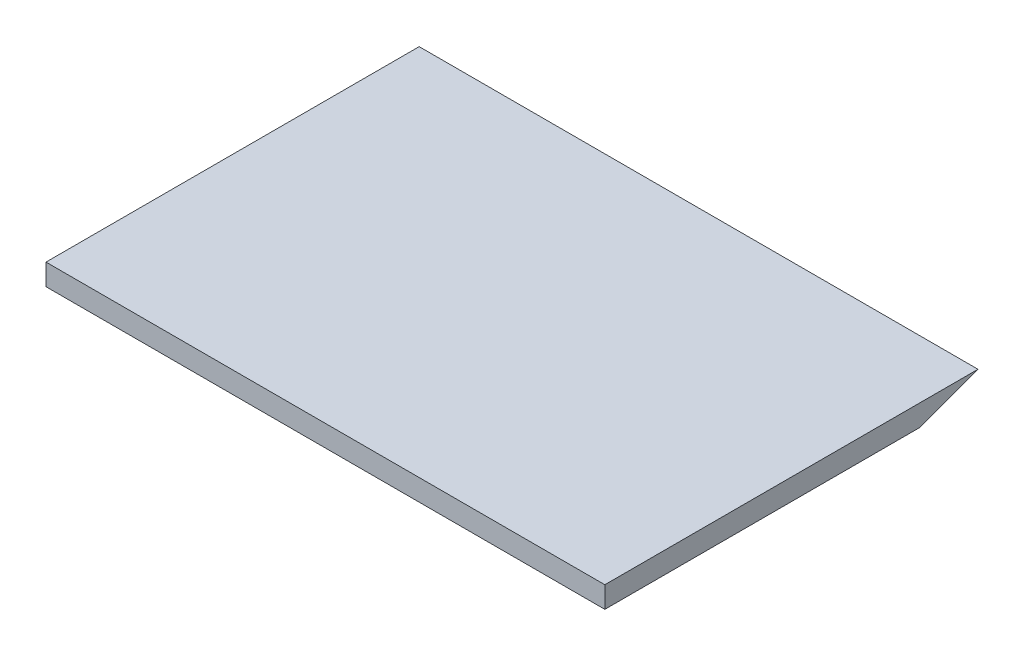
ISO-10303-21;
HEADER;
FILE_DESCRIPTION(('STEP AP214'),'2;1');
FILE_NAME('part.step','',(''),(''),'','','');
FILE_SCHEMA(('AUTOMOTIVE_DESIGN { 1 0 10303 214 1 1 1 1 }'));
ENDSEC;
DATA;
#1=APPLICATION_CONTEXT('core data for automotive mechanical design processes');
#2=APPLICATION_PROTOCOL_DEFINITION('international standard','automotive_design',2000,#1);
#3=PRODUCT_CONTEXT('',#1,'mechanical');
#4=PRODUCT('Part','Part','',(#3));
#5=PRODUCT_RELATED_PRODUCT_CATEGORY('part','',(#4));
#6=PRODUCT_DEFINITION_FORMATION('','',#4);
#7=PRODUCT_DEFINITION_CONTEXT('part definition',#1,'design');
#8=PRODUCT_DEFINITION('design','',#6,#7);
#9=PRODUCT_DEFINITION_SHAPE('','',#8);
#10=(LENGTH_UNIT() NAMED_UNIT(*) SI_UNIT(.MILLI.,.METRE.));
#11=(NAMED_UNIT(*) PLANE_ANGLE_UNIT() SI_UNIT($,.RADIAN.));
#12=(NAMED_UNIT(*) SI_UNIT($,.STERADIAN.) SOLID_ANGLE_UNIT());
#13=UNCERTAINTY_MEASURE_WITH_UNIT(LENGTH_MEASURE(1.E-05),#10,'distance_accuracy_value','');
#14=(GEOMETRIC_REPRESENTATION_CONTEXT(3) GLOBAL_UNCERTAINTY_ASSIGNED_CONTEXT((#13)) GLOBAL_UNIT_ASSIGNED_CONTEXT((#10,
#11,#12)) REPRESENTATION_CONTEXT('',''));
#15=CARTESIAN_POINT('',(0.,0.,0.));
#16=DIRECTION('',(0.,0.,1.));
#17=DIRECTION('',(1.,0.,0.));
#18=AXIS2_PLACEMENT_3D('',#15,#16,#17);
#19=CARTESIAN_POINT('',(-228.6,-8.73125,-305.308));
#20=DIRECTION('',(1.,0.,0.));
#21=DIRECTION('',(0.,0.,-1.));
#22=AXIS2_PLACEMENT_3D('',#19,#20,#21);
#23=PLANE('',#22);
#24=DIRECTION('',(0.,0.,1.));
#25=VECTOR('',#24,1.);
#26=CARTESIAN_POINT('',(-228.6,8.73125,-305.308));
#27=LINE('',#26,#25);
#28=CARTESIAN_POINT('',(-228.6,8.73125,-305.308));
#29=VERTEX_POINT('',#28);
#30=CARTESIAN_POINT('',(-228.6,8.73125,0.));
#31=VERTEX_POINT('',#30);
#32=EDGE_CURVE('E11',#29,#31,#27,.T.);
#33=ORIENTED_EDGE('',*,*,#32,.F.);
#34=DIRECTION('',(0.,-0.344888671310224,0.938643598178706));
#35=VECTOR('',#34,1.);
#36=CARTESIAN_POINT('',(-228.6,8.73125,-305.308));
#37=LINE('',#36,#35);
#38=CARTESIAN_POINT('',(-228.6,-8.73125,-257.782333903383));
#39=VERTEX_POINT('',#38);
#40=EDGE_CURVE('E47',#29,#39,#37,.T.);
#41=ORIENTED_EDGE('',*,*,#40,.T.);
#42=DIRECTION('',(0.,0.,1.));
#43=VECTOR('',#42,1.);
#44=CARTESIAN_POINT('',(-228.6,-8.73125,-305.308));
#45=LINE('',#44,#43);
#46=CARTESIAN_POINT('',(-228.6,-8.73125,0.));
#47=VERTEX_POINT('',#46);
#48=EDGE_CURVE('E75',#39,#47,#45,.T.);
#49=ORIENTED_EDGE('',*,*,#48,.T.);
#50=DIRECTION('',(0.,1.,0.));
#51=VECTOR('',#50,1.);
#52=CARTESIAN_POINT('',(-228.6,-8.73125,0.));
#53=LINE('',#52,#51);
#54=EDGE_CURVE('E88',#47,#31,#53,.T.);
#55=ORIENTED_EDGE('',*,*,#54,.T.);
#56=EDGE_LOOP('',(#33,#41,#49,#55));
#57=FACE_BOUND('',#56,.T.);
#58=ADVANCED_FACE('F32',(#57),#23,.F.);
#59=CARTESIAN_POINT('',(-228.6,8.73125,-305.308));
#60=DIRECTION('',(0.,-1.,0.));
#61=DIRECTION('',(0.,0.,-1.));
#62=AXIS2_PLACEMENT_3D('',#59,#60,#61);
#63=PLANE('',#62);
#64=DIRECTION('',(1.,0.,0.));
#65=VECTOR('',#64,1.);
#66=CARTESIAN_POINT('',(-228.6,8.73125,0.));
#67=LINE('',#66,#65);
#68=CARTESIAN_POINT('',(228.6,8.73125,0.));
#69=VERTEX_POINT('',#68);
#70=EDGE_CURVE('E83',#31,#69,#67,.T.);
#71=ORIENTED_EDGE('',*,*,#70,.T.);
#72=DIRECTION('',(0.,0.,1.));
#73=VECTOR('',#72,1.);
#74=CARTESIAN_POINT('',(228.6,8.73125,-305.308));
#75=LINE('',#74,#73);
#76=CARTESIAN_POINT('',(228.6,8.73125,-305.308));
#77=VERTEX_POINT('',#76);
#78=EDGE_CURVE('E40',#77,#69,#75,.T.);
#79=ORIENTED_EDGE('',*,*,#78,.F.);
#80=DIRECTION('',(1.,0.,0.));
#81=VECTOR('',#80,1.);
#82=CARTESIAN_POINT('',(-228.6,8.73125,-305.308));
#83=LINE('',#82,#81);
#84=EDGE_CURVE('E89',#29,#77,#83,.T.);
#85=ORIENTED_EDGE('',*,*,#84,.F.);
#86=ORIENTED_EDGE('',*,*,#32,.T.);
#87=EDGE_LOOP('',(#71,#79,#85,#86));
#88=FACE_BOUND('',#87,.T.);
#89=ADVANCED_FACE('F103',(#88),#63,.F.);
#90=CARTESIAN_POINT('',(228.6,-8.73125,-305.308));
#91=DIRECTION('',(1.,0.,0.));
#92=DIRECTION('',(0.,0.,-1.));
#93=AXIS2_PLACEMENT_3D('',#90,#91,#92);
#94=PLANE('',#93);
#95=DIRECTION('',(0.,-0.344888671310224,0.938643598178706));
#96=VECTOR('',#95,1.);
#97=CARTESIAN_POINT('',(228.6,8.73125,-305.308));
#98=LINE('',#97,#96);
#99=CARTESIAN_POINT('',(228.6,-8.73125,-257.782333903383));
#100=VERTEX_POINT('',#99);
#101=EDGE_CURVE('E100',#77,#100,#98,.T.);
#102=ORIENTED_EDGE('',*,*,#101,.F.);
#103=ORIENTED_EDGE('',*,*,#78,.T.);
#104=DIRECTION('',(0.,1.,0.));
#105=VECTOR('',#104,1.);
#106=CARTESIAN_POINT('',(228.6,-8.73125,0.));
#107=LINE('',#106,#105);
#108=CARTESIAN_POINT('',(228.6,-8.73125,0.));
#109=VERTEX_POINT('',#108);
#110=EDGE_CURVE('E78',#109,#69,#107,.T.);
#111=ORIENTED_EDGE('',*,*,#110,.F.);
#112=DIRECTION('',(0.,0.,1.));
#113=VECTOR('',#112,1.);
#114=CARTESIAN_POINT('',(228.6,-8.73125,-305.308));
#115=LINE('',#114,#113);
#116=EDGE_CURVE('E66',#100,#109,#115,.T.);
#117=ORIENTED_EDGE('',*,*,#116,.F.);
#118=EDGE_LOOP('',(#102,#103,#111,#117));
#119=FACE_BOUND('',#118,.T.);
#120=ADVANCED_FACE('F79',(#119),#94,.T.);
#121=CARTESIAN_POINT('',(-228.6,-8.73125,-305.308));
#122=DIRECTION('',(0.,-1.,0.));
#123=DIRECTION('',(0.,0.,-1.));
#124=AXIS2_PLACEMENT_3D('',#121,#122,#123);
#125=PLANE('',#124);
#126=DIRECTION('',(1.,0.,0.));
#127=VECTOR('',#126,1.);
#128=CARTESIAN_POINT('',(-228.6,-8.73125,-257.782333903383));
#129=LINE('',#128,#127);
#130=EDGE_CURVE('E72',#39,#100,#129,.T.);
#131=ORIENTED_EDGE('',*,*,#130,.T.);
#132=ORIENTED_EDGE('',*,*,#116,.T.);
#133=DIRECTION('',(1.,0.,0.));
#134=VECTOR('',#133,1.);
#135=CARTESIAN_POINT('',(-228.6,-8.73125,0.));
#136=LINE('',#135,#134);
#137=EDGE_CURVE('E71',#47,#109,#136,.T.);
#138=ORIENTED_EDGE('',*,*,#137,.F.);
#139=ORIENTED_EDGE('',*,*,#48,.F.);
#140=EDGE_LOOP('',(#131,#132,#138,#139));
#141=FACE_BOUND('',#140,.T.);
#142=ADVANCED_FACE('F68',(#141),#125,.T.);
#143=CARTESIAN_POINT('',(0.,0.,0.));
#144=DIRECTION('',(0.,0.,-1.));
#145=DIRECTION('',(-1.,0.,0.));
#146=AXIS2_PLACEMENT_3D('',#143,#144,#145);
#147=PLANE('',#146);
#148=ORIENTED_EDGE('',*,*,#54,.F.);
#149=ORIENTED_EDGE('',*,*,#137,.T.);
#150=ORIENTED_EDGE('',*,*,#110,.T.);
#151=ORIENTED_EDGE('',*,*,#70,.F.);
#152=EDGE_LOOP('',(#148,#149,#150,#151));
#153=FACE_BOUND('',#152,.T.);
#154=ADVANCED_FACE('F86',(#153),#147,.F.);
#155=CARTESIAN_POINT('',(-228.6,8.73125,-305.308));
#156=DIRECTION('',(0.,0.938643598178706,0.344888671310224));
#157=DIRECTION('',(0.,-0.344888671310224,0.938643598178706));
#158=AXIS2_PLACEMENT_3D('',#155,#156,#157);
#159=PLANE('',#158);
#160=ORIENTED_EDGE('',*,*,#101,.T.);
#161=ORIENTED_EDGE('',*,*,#130,.F.);
#162=ORIENTED_EDGE('',*,*,#40,.F.);
#163=ORIENTED_EDGE('',*,*,#84,.T.);
#164=EDGE_LOOP('',(#160,#161,#162,#163));
#165=FACE_BOUND('',#164,.T.);
#166=ADVANCED_FACE('F99',(#165),#159,.F.);
#167=CLOSED_SHELL('',(#58,#89,#120,#142,#154,#166));
#168=MANIFOLD_SOLID_BREP('B2',#167);
#169=ADVANCED_BREP_SHAPE_REPRESENTATION('',(#18,#168),#14);
#170=SHAPE_DEFINITION_REPRESENTATION(#9,#169);
ENDSEC;
END-ISO-10303-21;
